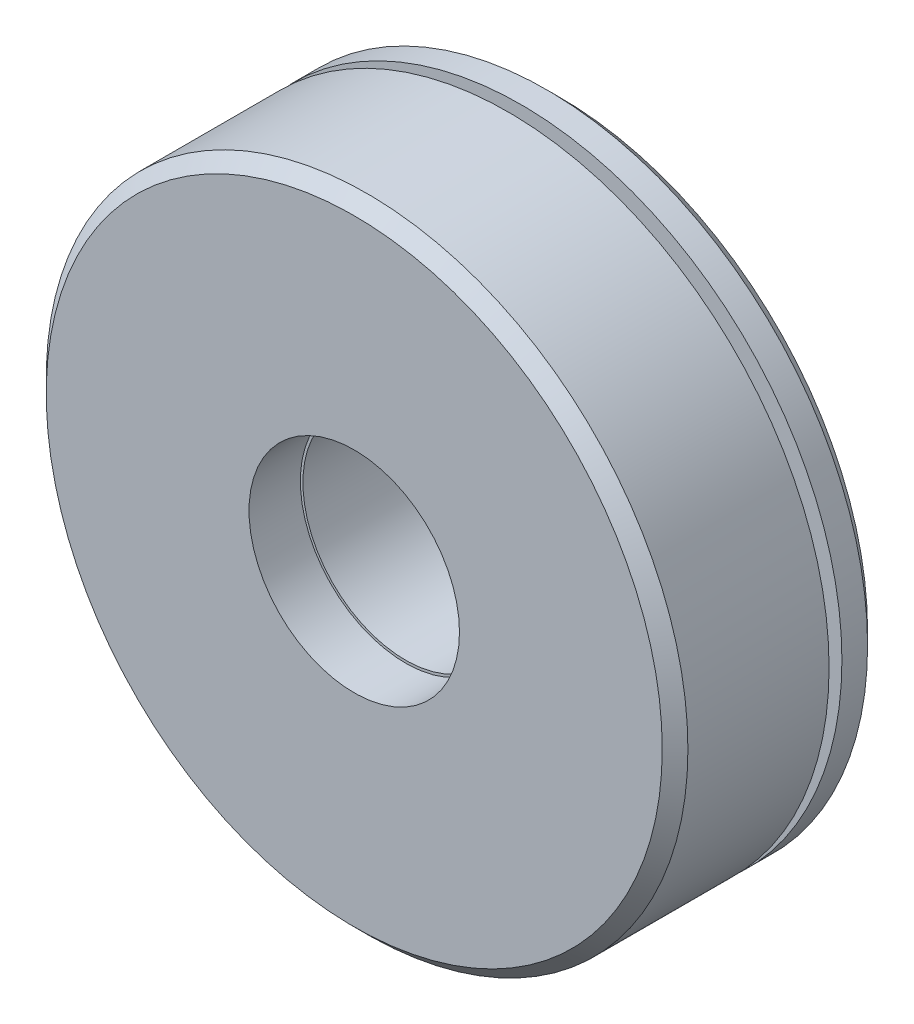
ISO-10303-21;
HEADER;
FILE_DESCRIPTION(('STEP AP214'),'2;1');
FILE_NAME('part.step','',(''),(''),'','','');
FILE_SCHEMA(('AUTOMOTIVE_DESIGN { 1 0 10303 214 1 1 1 1 }'));
ENDSEC;
DATA;
#1=APPLICATION_CONTEXT('core data for automotive mechanical design processes');
#2=APPLICATION_PROTOCOL_DEFINITION('international standard','automotive_design',2000,#1);
#3=PRODUCT_CONTEXT('',#1,'mechanical');
#4=PRODUCT('Part','Part','',(#3));
#5=PRODUCT_RELATED_PRODUCT_CATEGORY('part','',(#4));
#6=PRODUCT_DEFINITION_FORMATION('','',#4);
#7=PRODUCT_DEFINITION_CONTEXT('part definition',#1,'design');
#8=PRODUCT_DEFINITION('design','',#6,#7);
#9=PRODUCT_DEFINITION_SHAPE('','',#8);
#10=(LENGTH_UNIT() NAMED_UNIT(*) SI_UNIT(.MILLI.,.METRE.));
#11=(NAMED_UNIT(*) PLANE_ANGLE_UNIT() SI_UNIT($,.RADIAN.));
#12=(NAMED_UNIT(*) SI_UNIT($,.STERADIAN.) SOLID_ANGLE_UNIT());
#13=UNCERTAINTY_MEASURE_WITH_UNIT(LENGTH_MEASURE(1.E-05),#10,'distance_accuracy_value','');
#14=(GEOMETRIC_REPRESENTATION_CONTEXT(3) GLOBAL_UNCERTAINTY_ASSIGNED_CONTEXT((#13)) GLOBAL_UNIT_ASSIGNED_CONTEXT((#10,
#11,#12)) REPRESENTATION_CONTEXT('',''));
#15=CARTESIAN_POINT('',(0.,0.,0.));
#16=DIRECTION('',(0.,0.,1.));
#17=DIRECTION('',(1.,0.,0.));
#18=AXIS2_PLACEMENT_3D('',#15,#16,#17);
#19=CARTESIAN_POINT('',(0.,0.,7.5));
#20=DIRECTION('',(0.,0.,-1.));
#21=DIRECTION('',(-1.,0.,0.));
#22=AXIS2_PLACEMENT_3D('',#19,#20,#21);
#23=CONICAL_SURFACE('',#22,12.5,0.785398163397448);
#24=CARTESIAN_POINT('',(0.,0.,8.));
#25=DIRECTION('',(0.,0.,1.));
#26=DIRECTION('',(1.,0.,0.));
#27=AXIS2_PLACEMENT_3D('',#24,#25,#26);
#28=CIRCLE('',#27,12.);
#29=CARTESIAN_POINT('',(12.,0.,8.));
#30=VERTEX_POINT('',#29);
#31=EDGE_CURVE('E8',#30,#30,#28,.T.);
#32=ORIENTED_EDGE('',*,*,#31,.F.);
#33=EDGE_LOOP('',(#32));
#34=FACE_BOUND('',#33,.T.);
#35=CARTESIAN_POINT('',(0.,0.,7.5));
#36=DIRECTION('',(0.,0.,1.));
#37=DIRECTION('',(1.,0.,0.));
#38=AXIS2_PLACEMENT_3D('',#35,#36,#37);
#39=CIRCLE('',#38,12.5);
#40=CARTESIAN_POINT('',(12.5,0.,7.5));
#41=VERTEX_POINT('',#40);
#42=EDGE_CURVE('E59',#41,#41,#39,.T.);
#43=ORIENTED_EDGE('',*,*,#42,.T.);
#44=EDGE_LOOP('',(#43));
#45=FACE_BOUND('',#44,.T.);
#46=ADVANCED_FACE('F13',(#34,#45),#23,.T.);
#47=CARTESIAN_POINT('',(0.,12.,8.));
#48=DIRECTION('',(0.,0.,-1.));
#49=DIRECTION('',(-1.,0.,0.));
#50=AXIS2_PLACEMENT_3D('',#47,#48,#49);
#51=PLANE('',#50);
#52=CARTESIAN_POINT('',(0.,0.,8.));
#53=DIRECTION('',(0.,0.,1.));
#54=DIRECTION('',(1.,0.,0.));
#55=AXIS2_PLACEMENT_3D('',#52,#53,#54);
#56=CIRCLE('',#55,4.1);
#57=CARTESIAN_POINT('',(4.1,0.,8.));
#58=VERTEX_POINT('',#57);
#59=EDGE_CURVE('E19',#58,#58,#56,.T.);
#60=ORIENTED_EDGE('',*,*,#59,.F.);
#61=EDGE_LOOP('',(#60));
#62=FACE_BOUND('',#61,.T.);
#63=ORIENTED_EDGE('',*,*,#31,.T.);
#64=EDGE_LOOP('',(#63));
#65=FACE_BOUND('',#64,.T.);
#66=ADVANCED_FACE('F132',(#62,#65),#51,.F.);
#67=CARTESIAN_POINT('',(0.,0.,0.));
#68=DIRECTION('',(0.,0.,1.));
#69=DIRECTION('',(1.,0.,0.));
#70=AXIS2_PLACEMENT_3D('',#67,#68,#69);
#71=CYLINDRICAL_SURFACE('',#70,4.1);
#72=CARTESIAN_POINT('',(0.,0.,6.));
#73=DIRECTION('',(0.,0.,1.));
#74=DIRECTION('',(1.,0.,0.));
#75=AXIS2_PLACEMENT_3D('',#72,#73,#74);
#76=CIRCLE('',#75,4.1);
#77=CARTESIAN_POINT('',(4.1,0.,6.));
#78=VERTEX_POINT('',#77);
#79=EDGE_CURVE('E23',#78,#78,#76,.T.);
#80=ORIENTED_EDGE('',*,*,#79,.F.);
#81=EDGE_LOOP('',(#80));
#82=FACE_BOUND('',#81,.T.);
#83=ORIENTED_EDGE('',*,*,#59,.T.);
#84=EDGE_LOOP('',(#83));
#85=FACE_BOUND('',#84,.T.);
#86=ADVANCED_FACE('F127',(#82,#85),#71,.F.);
#87=CARTESIAN_POINT('',(0.,4.1,6.));
#88=DIRECTION('',(0.,0.,-1.));
#89=DIRECTION('',(-1.,0.,0.));
#90=AXIS2_PLACEMENT_3D('',#87,#88,#89);
#91=PLANE('',#90);
#92=CARTESIAN_POINT('',(0.,0.,6.));
#93=DIRECTION('',(0.,0.,1.));
#94=DIRECTION('',(1.,0.,0.));
#95=AXIS2_PLACEMENT_3D('',#92,#93,#94);
#96=CIRCLE('',#95,4.);
#97=CARTESIAN_POINT('',(4.,0.,6.));
#98=VERTEX_POINT('',#97);
#99=EDGE_CURVE('E27',#98,#98,#96,.T.);
#100=ORIENTED_EDGE('',*,*,#99,.F.);
#101=EDGE_LOOP('',(#100));
#102=FACE_BOUND('',#101,.T.);
#103=ORIENTED_EDGE('',*,*,#79,.T.);
#104=EDGE_LOOP('',(#103));
#105=FACE_BOUND('',#104,.T.);
#106=ADVANCED_FACE('F121',(#102,#105),#91,.F.);
#107=CARTESIAN_POINT('',(0.,0.,0.));
#108=DIRECTION('',(0.,0.,1.));
#109=DIRECTION('',(1.,0.,0.));
#110=AXIS2_PLACEMENT_3D('',#107,#108,#109);
#111=CYLINDRICAL_SURFACE('',#110,4.);
#112=CARTESIAN_POINT('',(0.,0.,2.));
#113=DIRECTION('',(0.,0.,1.));
#114=DIRECTION('',(1.,0.,0.));
#115=AXIS2_PLACEMENT_3D('',#112,#113,#114);
#116=CIRCLE('',#115,4.);
#117=CARTESIAN_POINT('',(4.,0.,2.));
#118=VERTEX_POINT('',#117);
#119=EDGE_CURVE('E32',#118,#118,#116,.T.);
#120=ORIENTED_EDGE('',*,*,#119,.F.);
#121=EDGE_LOOP('',(#120));
#122=FACE_BOUND('',#121,.T.);
#123=ORIENTED_EDGE('',*,*,#99,.T.);
#124=EDGE_LOOP('',(#123));
#125=FACE_BOUND('',#124,.T.);
#126=ADVANCED_FACE('F115',(#122,#125),#111,.F.);
#127=CARTESIAN_POINT('',(0.,4.,2.));
#128=DIRECTION('',(0.,0.,1.));
#129=DIRECTION('',(1.,0.,0.));
#130=AXIS2_PLACEMENT_3D('',#127,#128,#129);
#131=PLANE('',#130);
#132=CARTESIAN_POINT('',(0.,0.,2.));
#133=DIRECTION('',(0.,0.,1.));
#134=DIRECTION('',(1.,0.,0.));
#135=AXIS2_PLACEMENT_3D('',#132,#133,#134);
#136=CIRCLE('',#135,4.1);
#137=CARTESIAN_POINT('',(4.1,0.,2.));
#138=VERTEX_POINT('',#137);
#139=EDGE_CURVE('E35',#138,#138,#136,.T.);
#140=ORIENTED_EDGE('',*,*,#139,.F.);
#141=EDGE_LOOP('',(#140));
#142=FACE_BOUND('',#141,.T.);
#143=ORIENTED_EDGE('',*,*,#119,.T.);
#144=EDGE_LOOP('',(#143));
#145=FACE_BOUND('',#144,.T.);
#146=ADVANCED_FACE('F109',(#142,#145),#131,.F.);
#147=CARTESIAN_POINT('',(0.,0.,0.));
#148=DIRECTION('',(0.,0.,1.));
#149=DIRECTION('',(1.,0.,0.));
#150=AXIS2_PLACEMENT_3D('',#147,#148,#149);
#151=CYLINDRICAL_SURFACE('',#150,4.1);
#152=CARTESIAN_POINT('',(0.,0.,0.));
#153=DIRECTION('',(0.,0.,1.));
#154=DIRECTION('',(1.,0.,0.));
#155=AXIS2_PLACEMENT_3D('',#152,#153,#154);
#156=CIRCLE('',#155,4.1);
#157=CARTESIAN_POINT('',(4.1,0.,0.));
#158=VERTEX_POINT('',#157);
#159=EDGE_CURVE('E38',#158,#158,#156,.T.);
#160=ORIENTED_EDGE('',*,*,#159,.F.);
#161=EDGE_LOOP('',(#160));
#162=FACE_BOUND('',#161,.T.);
#163=ORIENTED_EDGE('',*,*,#139,.T.);
#164=EDGE_LOOP('',(#163));
#165=FACE_BOUND('',#164,.T.);
#166=ADVANCED_FACE('F103',(#162,#165),#151,.F.);
#167=CARTESIAN_POINT('',(0.,4.1,0.));
#168=DIRECTION('',(0.,0.,1.));
#169=DIRECTION('',(1.,0.,0.));
#170=AXIS2_PLACEMENT_3D('',#167,#168,#169);
#171=PLANE('',#170);
#172=CARTESIAN_POINT('',(0.,0.,0.));
#173=DIRECTION('',(0.,0.,1.));
#174=DIRECTION('',(1.,0.,0.));
#175=AXIS2_PLACEMENT_3D('',#172,#173,#174);
#176=CIRCLE('',#175,12.);
#177=CARTESIAN_POINT('',(12.,0.,0.));
#178=VERTEX_POINT('',#177);
#179=EDGE_CURVE('E41',#178,#178,#176,.T.);
#180=ORIENTED_EDGE('',*,*,#179,.F.);
#181=EDGE_LOOP('',(#180));
#182=FACE_BOUND('',#181,.T.);
#183=ORIENTED_EDGE('',*,*,#159,.T.);
#184=EDGE_LOOP('',(#183));
#185=FACE_BOUND('',#184,.T.);
#186=ADVANCED_FACE('F97',(#182,#185),#171,.F.);
#187=CARTESIAN_POINT('',(0.,0.,0.));
#188=DIRECTION('',(0.,0.,1.));
#189=DIRECTION('',(1.,0.,0.));
#190=AXIS2_PLACEMENT_3D('',#187,#188,#189);
#191=CONICAL_SURFACE('',#190,12.,0.785398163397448);
#192=CARTESIAN_POINT('',(0.,0.,0.5));
#193=DIRECTION('',(0.,0.,1.));
#194=DIRECTION('',(1.,0.,0.));
#195=AXIS2_PLACEMENT_3D('',#192,#193,#194);
#196=CIRCLE('',#195,12.5);
#197=CARTESIAN_POINT('',(12.5,0.,0.5));
#198=VERTEX_POINT('',#197);
#199=EDGE_CURVE('E44',#198,#198,#196,.T.);
#200=ORIENTED_EDGE('',*,*,#199,.F.);
#201=EDGE_LOOP('',(#200));
#202=FACE_BOUND('',#201,.T.);
#203=ORIENTED_EDGE('',*,*,#179,.T.);
#204=EDGE_LOOP('',(#203));
#205=FACE_BOUND('',#204,.T.);
#206=ADVANCED_FACE('F91',(#202,#205),#191,.T.);
#207=CARTESIAN_POINT('',(0.,0.,0.));
#208=DIRECTION('',(0.,0.,1.));
#209=DIRECTION('',(1.,0.,0.));
#210=AXIS2_PLACEMENT_3D('',#207,#208,#209);
#211=CYLINDRICAL_SURFACE('',#210,12.5);
#212=CARTESIAN_POINT('',(0.,0.,1.5));
#213=DIRECTION('',(0.,0.,1.));
#214=DIRECTION('',(1.,0.,0.));
#215=AXIS2_PLACEMENT_3D('',#212,#213,#214);
#216=CIRCLE('',#215,12.5);
#217=CARTESIAN_POINT('',(12.5,0.,1.5));
#218=VERTEX_POINT('',#217);
#219=EDGE_CURVE('E47',#218,#218,#216,.T.);
#220=ORIENTED_EDGE('',*,*,#219,.F.);
#221=EDGE_LOOP('',(#220));
#222=FACE_BOUND('',#221,.T.);
#223=ORIENTED_EDGE('',*,*,#199,.T.);
#224=EDGE_LOOP('',(#223));
#225=FACE_BOUND('',#224,.T.);
#226=ADVANCED_FACE('F85',(#222,#225),#211,.T.);
#227=CARTESIAN_POINT('',(0.,12.5,1.5));
#228=DIRECTION('',(0.,0.,-1.));
#229=DIRECTION('',(-1.,0.,0.));
#230=AXIS2_PLACEMENT_3D('',#227,#228,#229);
#231=PLANE('',#230);
#232=CARTESIAN_POINT('',(0.,0.,1.5));
#233=DIRECTION('',(0.,0.,1.));
#234=DIRECTION('',(1.,0.,0.));
#235=AXIS2_PLACEMENT_3D('',#232,#233,#234);
#236=CIRCLE('',#235,11.35);
#237=CARTESIAN_POINT('',(11.35,0.,1.5));
#238=VERTEX_POINT('',#237);
#239=EDGE_CURVE('E50',#238,#238,#236,.T.);
#240=ORIENTED_EDGE('',*,*,#239,.F.);
#241=EDGE_LOOP('',(#240));
#242=FACE_BOUND('',#241,.T.);
#243=ORIENTED_EDGE('',*,*,#219,.T.);
#244=EDGE_LOOP('',(#243));
#245=FACE_BOUND('',#244,.T.);
#246=ADVANCED_FACE('F79',(#242,#245),#231,.F.);
#247=CARTESIAN_POINT('',(0.,0.,0.));
#248=DIRECTION('',(0.,0.,1.));
#249=DIRECTION('',(1.,0.,0.));
#250=AXIS2_PLACEMENT_3D('',#247,#248,#249);
#251=CYLINDRICAL_SURFACE('',#250,11.35);
#252=CARTESIAN_POINT('',(0.,0.,2.));
#253=DIRECTION('',(0.,0.,1.));
#254=DIRECTION('',(1.,0.,0.));
#255=AXIS2_PLACEMENT_3D('',#252,#253,#254);
#256=CIRCLE('',#255,11.35);
#257=CARTESIAN_POINT('',(11.35,0.,2.));
#258=VERTEX_POINT('',#257);
#259=EDGE_CURVE('E53',#258,#258,#256,.T.);
#260=ORIENTED_EDGE('',*,*,#259,.F.);
#261=EDGE_LOOP('',(#260));
#262=FACE_BOUND('',#261,.T.);
#263=ORIENTED_EDGE('',*,*,#239,.T.);
#264=EDGE_LOOP('',(#263));
#265=FACE_BOUND('',#264,.T.);
#266=ADVANCED_FACE('F73',(#262,#265),#251,.T.);
#267=CARTESIAN_POINT('',(0.,11.35,2.));
#268=DIRECTION('',(0.,0.,1.));
#269=DIRECTION('',(1.,0.,0.));
#270=AXIS2_PLACEMENT_3D('',#267,#268,#269);
#271=PLANE('',#270);
#272=CARTESIAN_POINT('',(0.,0.,2.));
#273=DIRECTION('',(0.,0.,1.));
#274=DIRECTION('',(1.,0.,0.));
#275=AXIS2_PLACEMENT_3D('',#272,#273,#274);
#276=CIRCLE('',#275,12.5);
#277=CARTESIAN_POINT('',(12.5,0.,2.));
#278=VERTEX_POINT('',#277);
#279=EDGE_CURVE('E56',#278,#278,#276,.T.);
#280=ORIENTED_EDGE('',*,*,#279,.F.);
#281=EDGE_LOOP('',(#280));
#282=FACE_BOUND('',#281,.T.);
#283=ORIENTED_EDGE('',*,*,#259,.T.);
#284=EDGE_LOOP('',(#283));
#285=FACE_BOUND('',#284,.T.);
#286=ADVANCED_FACE('F67',(#282,#285),#271,.F.);
#287=CARTESIAN_POINT('',(0.,0.,0.));
#288=DIRECTION('',(0.,0.,1.));
#289=DIRECTION('',(1.,0.,0.));
#290=AXIS2_PLACEMENT_3D('',#287,#288,#289);
#291=CYLINDRICAL_SURFACE('',#290,12.5);
#292=ORIENTED_EDGE('',*,*,#42,.F.);
#293=EDGE_LOOP('',(#292));
#294=FACE_BOUND('',#293,.T.);
#295=ORIENTED_EDGE('',*,*,#279,.T.);
#296=EDGE_LOOP('',(#295));
#297=FACE_BOUND('',#296,.T.);
#298=ADVANCED_FACE('F64',(#294,#297),#291,.T.);
#299=CLOSED_SHELL('',(#46,#66,#86,#106,#126,#146,#166,#186,#206,#226,#246,#266,#286,#298));
#300=MANIFOLD_SOLID_BREP('B1',#299);
#301=ADVANCED_BREP_SHAPE_REPRESENTATION('',(#18,#300),#14);
#302=SHAPE_DEFINITION_REPRESENTATION(#9,#301);
ENDSEC;
END-ISO-10303-21;
